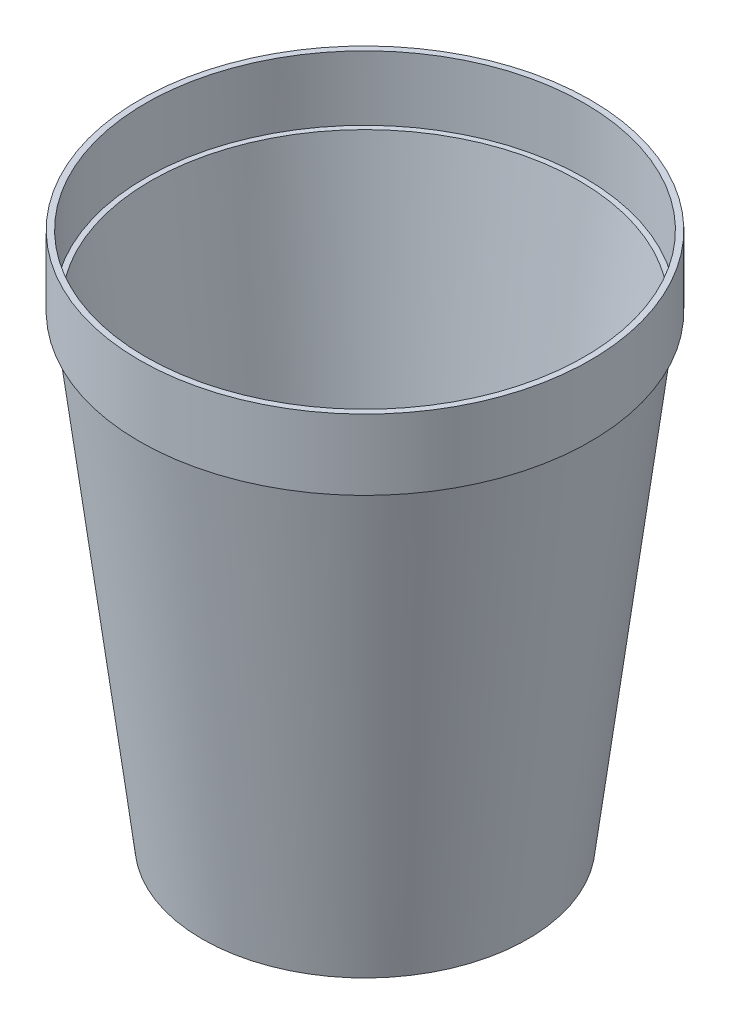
ISO-10303-21;
HEADER;
FILE_DESCRIPTION(('STEP AP214'),'2;1');
FILE_NAME('part.step','',(''),(''),'','','');
FILE_SCHEMA(('AUTOMOTIVE_DESIGN { 1 0 10303 214 1 1 1 1 }'));
ENDSEC;
DATA;
#1=APPLICATION_CONTEXT('core data for automotive mechanical design processes');
#2=APPLICATION_PROTOCOL_DEFINITION('international standard','automotive_design',2000,#1);
#3=PRODUCT_CONTEXT('',#1,'mechanical');
#4=PRODUCT('Part','Part','',(#3));
#5=PRODUCT_RELATED_PRODUCT_CATEGORY('part','',(#4));
#6=PRODUCT_DEFINITION_FORMATION('','',#4);
#7=PRODUCT_DEFINITION_CONTEXT('part definition',#1,'design');
#8=PRODUCT_DEFINITION('design','',#6,#7);
#9=PRODUCT_DEFINITION_SHAPE('','',#8);
#10=(LENGTH_UNIT() NAMED_UNIT(*) SI_UNIT(.MILLI.,.METRE.));
#11=(NAMED_UNIT(*) PLANE_ANGLE_UNIT() SI_UNIT($,.RADIAN.));
#12=(NAMED_UNIT(*) SI_UNIT($,.STERADIAN.) SOLID_ANGLE_UNIT());
#13=UNCERTAINTY_MEASURE_WITH_UNIT(LENGTH_MEASURE(1.E-05),#10,'distance_accuracy_value','');
#14=(GEOMETRIC_REPRESENTATION_CONTEXT(3) GLOBAL_UNCERTAINTY_ASSIGNED_CONTEXT((#13)) GLOBAL_UNIT_ASSIGNED_CONTEXT((#10,
#11,#12)) REPRESENTATION_CONTEXT('',''));
#15=CARTESIAN_POINT('',(0.,0.,0.));
#16=DIRECTION('',(0.,0.,1.));
#17=DIRECTION('',(1.,0.,0.));
#18=AXIS2_PLACEMENT_3D('',#15,#16,#17);
#19=CARTESIAN_POINT('',(55.,0.,0.));
#20=DIRECTION('',(0.,-1.,0.));
#21=DIRECTION('',(0.,0.,-1.));
#22=AXIS2_PLACEMENT_3D('',#19,#20,#21);
#23=PLANE('',#22);
#24=CARTESIAN_POINT('',(0.,0.,0.));
#25=DIRECTION('',(0.,-1.,0.));
#26=DIRECTION('',(0.,0.,-1.));
#27=AXIS2_PLACEMENT_3D('',#24,#25,#26);
#28=CIRCLE('',#27,55.);
#29=CARTESIAN_POINT('',(0.,0.,-55.));
#30=VERTEX_POINT('',#29);
#31=EDGE_CURVE('E44',#30,#30,#28,.T.);
#32=ORIENTED_EDGE('',*,*,#31,.T.);
#33=EDGE_LOOP('',(#32));
#34=FACE_BOUND('',#33,.T.);
#35=ADVANCED_FACE('F30',(#34),#23,.T.);
#36=CARTESIAN_POINT('',(0.,180.,0.));
#37=DIRECTION('',(0.,1.,0.));
#38=DIRECTION('',(0.,0.,1.));
#39=AXIS2_PLACEMENT_3D('',#36,#37,#38);
#40=PLANE('',#39);
#41=CARTESIAN_POINT('',(0.,180.,0.));
#42=DIRECTION('',(0.,1.,0.));
#43=DIRECTION('',(0.,0.,1.));
#44=AXIS2_PLACEMENT_3D('',#41,#42,#43);
#45=CIRCLE('',#44,74.1785073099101);
#46=CARTESIAN_POINT('',(0.,180.,74.1785073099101));
#47=VERTEX_POINT('',#46);
#48=EDGE_CURVE('E49',#47,#47,#45,.F.);
#49=ORIENTED_EDGE('',*,*,#48,.T.);
#50=EDGE_LOOP('',(#49));
#51=FACE_BOUND('',#50,.T.);
#52=CARTESIAN_POINT('',(0.,180.,0.));
#53=DIRECTION('',(0.,-1.,0.));
#54=DIRECTION('',(0.,0.,-1.));
#55=AXIS2_PLACEMENT_3D('',#52,#53,#54);
#56=CIRCLE('',#55,76.1785073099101);
#57=CARTESIAN_POINT('',(0.,180.,-76.1785073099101));
#58=VERTEX_POINT('',#57);
#59=EDGE_CURVE('E10',#58,#58,#56,.T.);
#60=ORIENTED_EDGE('',*,*,#59,.F.);
#61=EDGE_LOOP('',(#60));
#62=FACE_BOUND('',#61,.T.);
#63=ADVANCED_FACE('F80',(#51,#62),#40,.T.);
#64=CARTESIAN_POINT('',(0.,0.,0.));
#65=DIRECTION('',(0.,-1.,0.));
#66=DIRECTION('',(0.,0.,-1.));
#67=AXIS2_PLACEMENT_3D('',#64,#65,#66);
#68=CYLINDRICAL_SURFACE('',#67,76.1785073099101);
#69=ORIENTED_EDGE('',*,*,#59,.T.);
#70=EDGE_LOOP('',(#69));
#71=FACE_BOUND('',#70,.T.);
#72=CARTESIAN_POINT('',(0.,156.196407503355,0.));
#73=DIRECTION('',(0.,-1.,0.));
#74=DIRECTION('',(0.,0.,-1.));
#75=AXIS2_PLACEMENT_3D('',#72,#73,#74);
#76=CIRCLE('',#75,76.1785073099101);
#77=CARTESIAN_POINT('',(0.,156.196407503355,-76.1785073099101));
#78=VERTEX_POINT('',#77);
#79=EDGE_CURVE('E36',#78,#78,#76,.T.);
#80=ORIENTED_EDGE('',*,*,#79,.F.);
#81=EDGE_LOOP('',(#80));
#82=FACE_BOUND('',#81,.T.);
#83=ADVANCED_FACE('F85',(#71,#82),#68,.T.);
#84=CARTESIAN_POINT('',(76.1785073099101,156.196407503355,0.));
#85=DIRECTION('',(0.,-1.,0.));
#86=DIRECTION('',(0.,0.,-1.));
#87=AXIS2_PLACEMENT_3D('',#84,#85,#86);
#88=PLANE('',#87);
#89=ORIENTED_EDGE('',*,*,#79,.T.);
#90=EDGE_LOOP('',(#89));
#91=FACE_BOUND('',#90,.T.);
#92=CARTESIAN_POINT('',(0.,156.196407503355,0.));
#93=DIRECTION('',(0.,-1.,0.));
#94=DIRECTION('',(0.,0.,-1.));
#95=AXIS2_PLACEMENT_3D('',#92,#93,#94);
#96=CIRCLE('',#95,74.1785073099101);
#97=CARTESIAN_POINT('',(0.,156.196407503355,-74.1785073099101));
#98=VERTEX_POINT('',#97);
#99=EDGE_CURVE('E40',#98,#98,#96,.T.);
#100=ORIENTED_EDGE('',*,*,#99,.F.);
#101=EDGE_LOOP('',(#100));
#102=FACE_BOUND('',#101,.T.);
#103=ADVANCED_FACE('F76',(#91,#102),#88,.T.);
#104=CARTESIAN_POINT('',(0.,0.,0.));
#105=DIRECTION('',(0.,1.,0.));
#106=DIRECTION('',(0.,0.,1.));
#107=AXIS2_PLACEMENT_3D('',#104,#105,#106);
#108=CONICAL_SURFACE('',#107,55.,0.1221730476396);
#109=ORIENTED_EDGE('',*,*,#99,.T.);
#110=EDGE_LOOP('',(#109));
#111=FACE_BOUND('',#110,.T.);
#112=ORIENTED_EDGE('',*,*,#31,.F.);
#113=EDGE_LOOP('',(#112));
#114=FACE_BOUND('',#113,.T.);
#115=ADVANCED_FACE('F67',(#111,#114),#108,.T.);
#116=CARTESIAN_POINT('',(55.,2.,0.));
#117=DIRECTION('',(0.,-1.,0.));
#118=DIRECTION('',(0.,0.,-1.));
#119=AXIS2_PLACEMENT_3D('',#116,#117,#118);
#120=PLANE('',#119);
#121=CARTESIAN_POINT('',(0.,2.,0.));
#122=DIRECTION('',(0.,-1.,0.));
#123=DIRECTION('',(0.,0.,-1.));
#124=AXIS2_PLACEMENT_3D('',#121,#122,#123);
#125=CIRCLE('',#124,53.2305494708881);
#126=CARTESIAN_POINT('',(0.,2.,-53.2305494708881));
#127=VERTEX_POINT('',#126);
#128=EDGE_CURVE('E58',#127,#127,#125,.T.);
#129=ORIENTED_EDGE('',*,*,#128,.F.);
#130=EDGE_LOOP('',(#129));
#131=FACE_BOUND('',#130,.T.);
#132=ADVANCED_FACE('F64',(#131),#120,.F.);
#133=CARTESIAN_POINT('',(0.,0.,0.));
#134=DIRECTION('',(0.,-1.,0.));
#135=DIRECTION('',(0.,0.,-1.));
#136=AXIS2_PLACEMENT_3D('',#133,#134,#135);
#137=CYLINDRICAL_SURFACE('',#136,74.1785073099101);
#138=ORIENTED_EDGE('',*,*,#48,.F.);
#139=EDGE_LOOP('',(#138));
#140=FACE_BOUND('',#139,.T.);
#141=CARTESIAN_POINT('',(0.,158.196407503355,0.));
#142=DIRECTION('',(0.,-1.,0.));
#143=DIRECTION('',(0.,0.,-1.));
#144=AXIS2_PLACEMENT_3D('',#141,#142,#143);
#145=CIRCLE('',#144,74.1785073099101);
#146=CARTESIAN_POINT('',(0.,158.196407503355,-74.1785073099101));
#147=VERTEX_POINT('',#146);
#148=EDGE_CURVE('E52',#147,#147,#145,.T.);
#149=ORIENTED_EDGE('',*,*,#148,.T.);
#150=EDGE_LOOP('',(#149));
#151=FACE_BOUND('',#150,.T.);
#152=ADVANCED_FACE('F66',(#140,#151),#137,.F.);
#153=CARTESIAN_POINT('',(76.1785073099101,158.196407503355,0.));
#154=DIRECTION('',(0.,-1.,0.));
#155=DIRECTION('',(0.,0.,-1.));
#156=AXIS2_PLACEMENT_3D('',#153,#154,#155);
#157=PLANE('',#156);
#158=ORIENTED_EDGE('',*,*,#148,.F.);
#159=EDGE_LOOP('',(#158));
#160=FACE_BOUND('',#159,.T.);
#161=CARTESIAN_POINT('',(0.,158.196407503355,0.));
#162=DIRECTION('',(0.,-1.,0.));
#163=DIRECTION('',(0.,0.,-1.));
#164=AXIS2_PLACEMENT_3D('',#161,#162,#163);
#165=CIRCLE('',#164,72.4090567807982);
#166=CARTESIAN_POINT('',(0.,158.196407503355,-72.4090567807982));
#167=VERTEX_POINT('',#166);
#168=EDGE_CURVE('E55',#167,#167,#165,.T.);
#169=ORIENTED_EDGE('',*,*,#168,.T.);
#170=EDGE_LOOP('',(#169));
#171=FACE_BOUND('',#170,.T.);
#172=ADVANCED_FACE('F73',(#160,#171),#157,.F.);
#173=CARTESIAN_POINT('',(0.,0.243738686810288,0.));
#174=DIRECTION('',(0.,1.,0.));
#175=DIRECTION('',(0.,0.,1.));
#176=AXIS2_PLACEMENT_3D('',#173,#174,#175);
#177=CONICAL_SURFACE('',#176,53.0149076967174,0.1221730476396);
#178=ORIENTED_EDGE('',*,*,#168,.F.);
#179=EDGE_LOOP('',(#178));
#180=FACE_BOUND('',#179,.T.);
#181=ORIENTED_EDGE('',*,*,#128,.T.);
#182=EDGE_LOOP('',(#181));
#183=FACE_BOUND('',#182,.T.);
#184=ADVANCED_FACE('F62',(#180,#183),#177,.F.);
#185=CLOSED_SHELL('',(#35,#63,#83,#103,#115,#132,#152,#172,#184));
#186=MANIFOLD_SOLID_BREP('B2',#185);
#187=ADVANCED_BREP_SHAPE_REPRESENTATION('',(#18,#186),#14);
#188=SHAPE_DEFINITION_REPRESENTATION(#9,#187);
ENDSEC;
END-ISO-10303-21;
